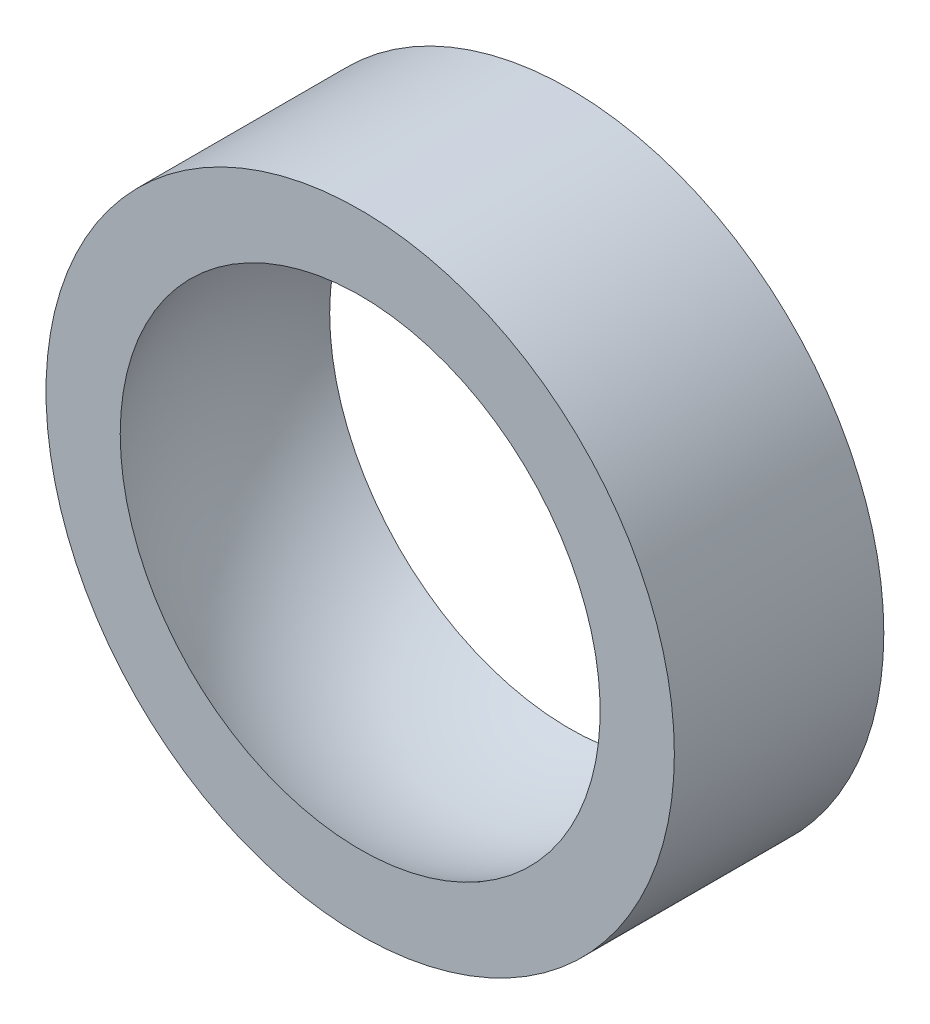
from build123d import *

# Parameters (mm, degrees)
ESQUISSE1_R          = 15
BASE_EXTRUSION_DEPTH = 5


with BuildPart() as part:
    # Esquisse1 → Base-Extrusion (new, symmetric)
    with BuildSketch(Plane.XY):
        Circle(ESQUISSE1_R)
    extrude(amount=BASE_EXTRUSION_DEPTH, both=True)

    # Esquisse2 → Enl_vement de mati_re-R_volution1 (revolve, cut)
    with BuildSketch(Plane(origin=(0, 0, 0), x_dir=(1, 0, 0), z_dir=(0, 1, 0))):
        with BuildLine():
            Line((0, 12.5), (0, -12.5))
            ThreePointArc((0, -12.5), (12.5, 0), (0, 12.5))
        make_face()
    revolve(axis=Axis((0, 0, -40), (0, 0, 1)), mode=Mode.SUBTRACT)


solid = part.part
